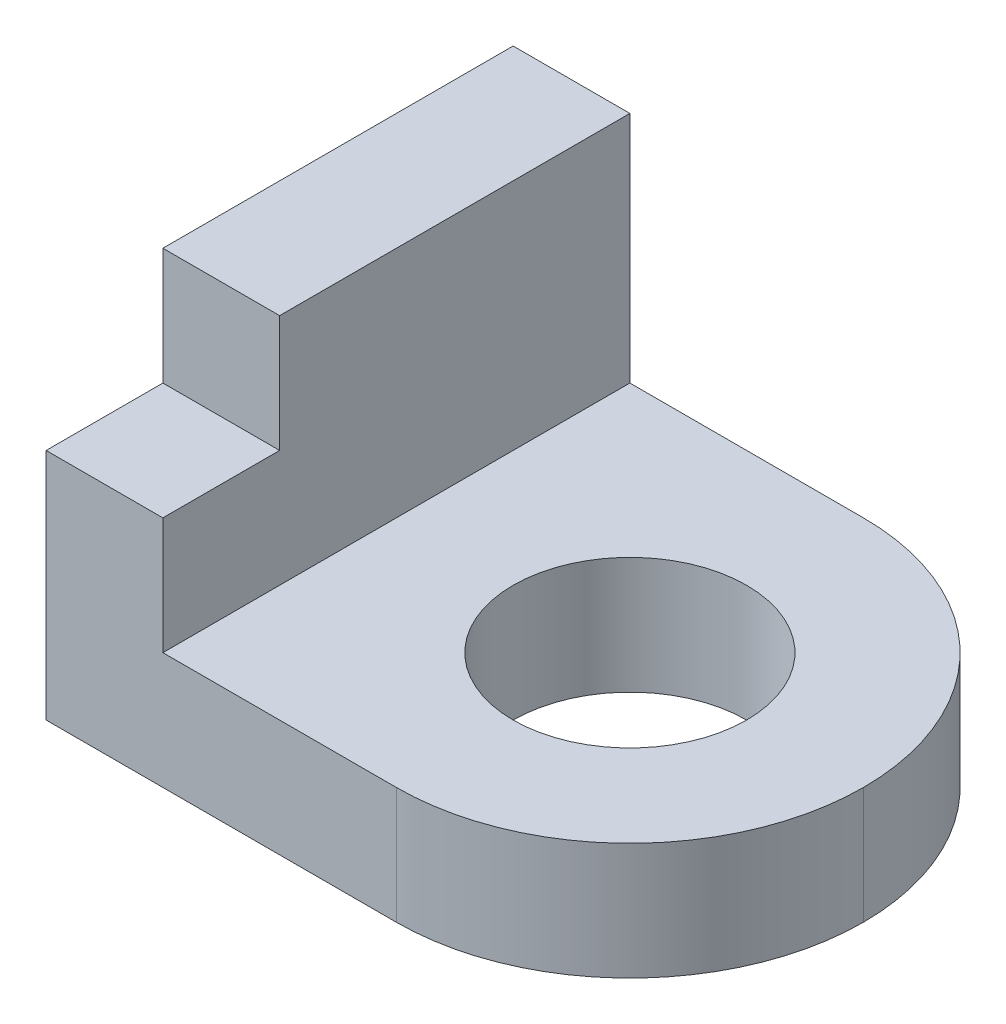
ISO-10303-21;
HEADER;
FILE_DESCRIPTION(('STEP AP214'),'2;1');
FILE_NAME('part.step','',(''),(''),'','','');
FILE_SCHEMA(('AUTOMOTIVE_DESIGN { 1 0 10303 214 1 1 1 1 }'));
ENDSEC;
DATA;
#1=APPLICATION_CONTEXT('core data for automotive mechanical design processes');
#2=APPLICATION_PROTOCOL_DEFINITION('international standard','automotive_design',2000,#1);
#3=PRODUCT_CONTEXT('',#1,'mechanical');
#4=PRODUCT('Part','Part','',(#3));
#5=PRODUCT_RELATED_PRODUCT_CATEGORY('part','',(#4));
#6=PRODUCT_DEFINITION_FORMATION('','',#4);
#7=PRODUCT_DEFINITION_CONTEXT('part definition',#1,'design');
#8=PRODUCT_DEFINITION('design','',#6,#7);
#9=PRODUCT_DEFINITION_SHAPE('','',#8);
#10=(LENGTH_UNIT() NAMED_UNIT(*) SI_UNIT(.MILLI.,.METRE.));
#11=(NAMED_UNIT(*) PLANE_ANGLE_UNIT() SI_UNIT($,.RADIAN.));
#12=(NAMED_UNIT(*) SI_UNIT($,.STERADIAN.) SOLID_ANGLE_UNIT());
#13=UNCERTAINTY_MEASURE_WITH_UNIT(LENGTH_MEASURE(1.E-05),#10,'distance_accuracy_value','');
#14=(GEOMETRIC_REPRESENTATION_CONTEXT(3) GLOBAL_UNCERTAINTY_ASSIGNED_CONTEXT((#13)) GLOBAL_UNIT_ASSIGNED_CONTEXT((#10,
#11,#12)) REPRESENTATION_CONTEXT('',''));
#15=CARTESIAN_POINT('',(0.,0.,0.));
#16=DIRECTION('',(0.,0.,1.));
#17=DIRECTION('',(1.,0.,0.));
#18=AXIS2_PLACEMENT_3D('',#15,#16,#17);
#19=CARTESIAN_POINT('',(-24.9460396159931,10.,-20.));
#20=DIRECTION('',(0.,0.,-1.));
#21=DIRECTION('',(-1.,0.,0.));
#22=AXIS2_PLACEMENT_3D('',#19,#20,#21);
#23=PLANE('',#22);
#24=DIRECTION('',(1.,0.,0.));
#25=VECTOR('',#24,1.);
#26=CARTESIAN_POINT('',(-24.9460396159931,10.,-20.));
#27=LINE('',#26,#25);
#28=CARTESIAN_POINT('',(10.,10.,-20.));
#29=VERTEX_POINT('',#28);
#30=CARTESIAN_POINT('',(30.,10.,-20.));
#31=VERTEX_POINT('',#30);
#32=EDGE_CURVE('E155',#29,#31,#27,.T.);
#33=ORIENTED_EDGE('',*,*,#32,.T.);
#34=DIRECTION('',(0.,-1.,0.));
#35=VECTOR('',#34,1.);
#36=CARTESIAN_POINT('',(30.,10.,-20.));
#37=LINE('',#36,#35);
#38=CARTESIAN_POINT('',(30.,0.,-20.));
#39=VERTEX_POINT('',#38);
#40=EDGE_CURVE('E158',#31,#39,#37,.T.);
#41=ORIENTED_EDGE('',*,*,#40,.T.);
#42=DIRECTION('',(1.,0.,0.));
#43=VECTOR('',#42,1.);
#44=CARTESIAN_POINT('',(-24.9460396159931,0.,-20.));
#45=LINE('',#44,#43);
#46=CARTESIAN_POINT('',(0.,0.,-20.));
#47=VERTEX_POINT('',#46);
#48=EDGE_CURVE('E148',#47,#39,#45,.T.);
#49=ORIENTED_EDGE('',*,*,#48,.F.);
#50=DIRECTION('',(0.,-1.,0.));
#51=VECTOR('',#50,1.);
#52=CARTESIAN_POINT('',(0.,30.,-20.));
#53=LINE('',#52,#51);
#54=CARTESIAN_POINT('',(0.,30.,-20.));
#55=VERTEX_POINT('',#54);
#56=EDGE_CURVE('E135',#55,#47,#53,.T.);
#57=ORIENTED_EDGE('',*,*,#56,.F.);
#58=DIRECTION('',(1.,0.,0.));
#59=VECTOR('',#58,1.);
#60=CARTESIAN_POINT('',(-24.9460396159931,30.,-20.));
#61=LINE('',#60,#59);
#62=CARTESIAN_POINT('',(10.,30.,-20.));
#63=VERTEX_POINT('',#62);
#64=EDGE_CURVE('E123',#55,#63,#61,.T.);
#65=ORIENTED_EDGE('',*,*,#64,.T.);
#66=DIRECTION('',(0.,-1.,0.));
#67=VECTOR('',#66,1.);
#68=CARTESIAN_POINT('',(10.,30.,-20.));
#69=LINE('',#68,#67);
#70=EDGE_CURVE('E138',#63,#29,#69,.T.);
#71=ORIENTED_EDGE('',*,*,#70,.T.);
#72=EDGE_LOOP('',(#33,#41,#49,#57,#65,#71));
#73=FACE_BOUND('',#72,.T.);
#74=ADVANCED_FACE('F32',(#73),#23,.T.);
#75=CARTESIAN_POINT('',(-24.9460396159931,10.,20.));
#76=DIRECTION('',(0.,0.,-1.));
#77=DIRECTION('',(-1.,0.,0.));
#78=AXIS2_PLACEMENT_3D('',#75,#76,#77);
#79=PLANE('',#78);
#80=DIRECTION('',(0.,-1.,0.));
#81=VECTOR('',#80,1.);
#82=CARTESIAN_POINT('',(10.,30.,20.));
#83=LINE('',#82,#81);
#84=CARTESIAN_POINT('',(10.,20.,20.));
#85=VERTEX_POINT('',#84);
#86=CARTESIAN_POINT('',(10.,10.,20.));
#87=VERTEX_POINT('',#86);
#88=EDGE_CURVE('E36',#85,#87,#83,.T.);
#89=ORIENTED_EDGE('',*,*,#88,.F.);
#90=DIRECTION('',(-1.,0.,0.));
#91=VECTOR('',#90,1.);
#92=CARTESIAN_POINT('',(50.,20.,20.));
#93=LINE('',#92,#91);
#94=CARTESIAN_POINT('',(0.,20.,20.));
#95=VERTEX_POINT('',#94);
#96=EDGE_CURVE('E191',#85,#95,#93,.T.);
#97=ORIENTED_EDGE('',*,*,#96,.T.);
#98=DIRECTION('',(0.,-1.,0.));
#99=VECTOR('',#98,1.);
#100=CARTESIAN_POINT('',(0.,30.,20.));
#101=LINE('',#100,#99);
#102=CARTESIAN_POINT('',(0.,0.,20.));
#103=VERTEX_POINT('',#102);
#104=EDGE_CURVE('E145',#95,#103,#101,.T.);
#105=ORIENTED_EDGE('',*,*,#104,.T.);
#106=DIRECTION('',(1.,0.,0.));
#107=VECTOR('',#106,1.);
#108=CARTESIAN_POINT('',(-24.9460396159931,0.,20.));
#109=LINE('',#108,#107);
#110=CARTESIAN_POINT('',(30.,0.,20.));
#111=VERTEX_POINT('',#110);
#112=EDGE_CURVE('E156',#103,#111,#109,.T.);
#113=ORIENTED_EDGE('',*,*,#112,.T.);
#114=DIRECTION('',(0.,-1.,0.));
#115=VECTOR('',#114,1.);
#116=CARTESIAN_POINT('',(30.,10.,20.));
#117=LINE('',#116,#115);
#118=CARTESIAN_POINT('',(30.,10.,20.));
#119=VERTEX_POINT('',#118);
#120=EDGE_CURVE('E42',#111,#119,#117,.F.);
#121=ORIENTED_EDGE('',*,*,#120,.T.);
#122=DIRECTION('',(1.,0.,0.));
#123=VECTOR('',#122,1.);
#124=CARTESIAN_POINT('',(-24.9460396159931,10.,20.));
#125=LINE('',#124,#123);
#126=EDGE_CURVE('E154',#87,#119,#125,.T.);
#127=ORIENTED_EDGE('',*,*,#126,.F.);
#128=EDGE_LOOP('',(#89,#97,#105,#113,#121,#127));
#129=FACE_BOUND('',#128,.T.);
#130=ADVANCED_FACE('F200',(#129),#79,.F.);
#131=CARTESIAN_POINT('',(-24.9460396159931,10.,0.));
#132=DIRECTION('',(0.,1.,0.));
#133=DIRECTION('',(0.,0.,1.));
#134=AXIS2_PLACEMENT_3D('',#131,#132,#133);
#135=PLANE('',#134);
#136=CARTESIAN_POINT('',(30.,10.,0.));
#137=DIRECTION('',(0.,1.,0.));
#138=DIRECTION('',(0.,0.,1.));
#139=AXIS2_PLACEMENT_3D('',#136,#137,#138);
#140=CIRCLE('',#139,10.);
#141=CARTESIAN_POINT('',(30.,10.,10.));
#142=VERTEX_POINT('',#141);
#143=EDGE_CURVE('E132',#142,#142,#140,.T.);
#144=ORIENTED_EDGE('',*,*,#143,.F.);
#145=EDGE_LOOP('',(#144));
#146=FACE_BOUND('',#145,.T.);
#147=CARTESIAN_POINT('',(30.,10.,0.));
#148=DIRECTION('',(0.,1.,0.));
#149=DIRECTION('',(0.,0.,1.));
#150=AXIS2_PLACEMENT_3D('',#147,#148,#149);
#151=CIRCLE('',#150,20.);
#152=CARTESIAN_POINT('',(50.,10.,0.));
#153=VERTEX_POINT('',#152);
#154=EDGE_CURVE('E171',#119,#153,#151,.T.);
#155=ORIENTED_EDGE('',*,*,#154,.T.);
#156=CARTESIAN_POINT('',(30.,10.,0.));
#157=DIRECTION('',(0.,1.,0.));
#158=DIRECTION('',(0.,0.,1.));
#159=AXIS2_PLACEMENT_3D('',#156,#157,#158);
#160=CIRCLE('',#159,20.);
#161=EDGE_CURVE('E173',#153,#31,#160,.T.);
#162=ORIENTED_EDGE('',*,*,#161,.T.);
#163=ORIENTED_EDGE('',*,*,#32,.F.);
#164=DIRECTION('',(0.,0.,1.));
#165=VECTOR('',#164,1.);
#166=CARTESIAN_POINT('',(10.,10.,0.));
#167=LINE('',#166,#165);
#168=EDGE_CURVE('E151',#29,#87,#167,.T.);
#169=ORIENTED_EDGE('',*,*,#168,.T.);
#170=ORIENTED_EDGE('',*,*,#126,.T.);
#171=EDGE_LOOP('',(#155,#162,#163,#169,#170));
#172=FACE_BOUND('',#171,.T.);
#173=ADVANCED_FACE('F208',(#146,#172),#135,.T.);
#174=CARTESIAN_POINT('',(-24.9460396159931,0.,0.));
#175=DIRECTION('',(0.,1.,0.));
#176=DIRECTION('',(0.,0.,1.));
#177=AXIS2_PLACEMENT_3D('',#174,#175,#176);
#178=PLANE('',#177);
#179=CARTESIAN_POINT('',(30.,0.,0.));
#180=DIRECTION('',(0.,-1.,0.));
#181=DIRECTION('',(0.,0.,-1.));
#182=AXIS2_PLACEMENT_3D('',#179,#180,#181);
#183=CIRCLE('',#182,10.);
#184=CARTESIAN_POINT('',(30.,0.,-10.));
#185=VERTEX_POINT('',#184);
#186=EDGE_CURVE('E181',#185,#185,#183,.T.);
#187=ORIENTED_EDGE('',*,*,#186,.F.);
#188=EDGE_LOOP('',(#187));
#189=FACE_BOUND('',#188,.T.);
#190=ORIENTED_EDGE('',*,*,#48,.T.);
#191=CARTESIAN_POINT('',(30.,0.,0.));
#192=DIRECTION('',(0.,1.,0.));
#193=DIRECTION('',(0.,0.,1.));
#194=AXIS2_PLACEMENT_3D('',#191,#192,#193);
#195=CIRCLE('',#194,20.);
#196=CARTESIAN_POINT('',(50.,0.,0.));
#197=VERTEX_POINT('',#196);
#198=EDGE_CURVE('E169',#39,#197,#195,.F.);
#199=ORIENTED_EDGE('',*,*,#198,.T.);
#200=CARTESIAN_POINT('',(30.,0.,0.));
#201=DIRECTION('',(0.,1.,0.));
#202=DIRECTION('',(0.,0.,1.));
#203=AXIS2_PLACEMENT_3D('',#200,#201,#202);
#204=CIRCLE('',#203,20.);
#205=EDGE_CURVE('E167',#197,#111,#204,.F.);
#206=ORIENTED_EDGE('',*,*,#205,.T.);
#207=ORIENTED_EDGE('',*,*,#112,.F.);
#208=DIRECTION('',(0.,0.,1.));
#209=VECTOR('',#208,1.);
#210=CARTESIAN_POINT('',(0.,0.,0.));
#211=LINE('',#210,#209);
#212=EDGE_CURVE('E125',#47,#103,#211,.T.);
#213=ORIENTED_EDGE('',*,*,#212,.F.);
#214=EDGE_LOOP('',(#190,#199,#206,#207,#213));
#215=FACE_BOUND('',#214,.T.);
#216=ADVANCED_FACE('F215',(#189,#215),#178,.F.);
#217=CARTESIAN_POINT('',(10.,30.,0.));
#218=DIRECTION('',(1.,0.,0.));
#219=DIRECTION('',(0.,0.,-1.));
#220=AXIS2_PLACEMENT_3D('',#217,#218,#219);
#221=PLANE('',#220);
#222=DIRECTION('',(0.,0.,-1.));
#223=VECTOR('',#222,1.);
#224=CARTESIAN_POINT('',(10.,20.,0.));
#225=LINE('',#224,#223);
#226=CARTESIAN_POINT('',(10.,20.,10.));
#227=VERTEX_POINT('',#226);
#228=EDGE_CURVE('E185',#85,#227,#225,.T.);
#229=ORIENTED_EDGE('',*,*,#228,.F.);
#230=ORIENTED_EDGE('',*,*,#88,.T.);
#231=ORIENTED_EDGE('',*,*,#168,.F.);
#232=ORIENTED_EDGE('',*,*,#70,.F.);
#233=DIRECTION('',(0.,0.,1.));
#234=VECTOR('',#233,1.);
#235=CARTESIAN_POINT('',(10.,30.,0.));
#236=LINE('',#235,#234);
#237=CARTESIAN_POINT('',(10.,30.,10.));
#238=VERTEX_POINT('',#237);
#239=EDGE_CURVE('E124',#63,#238,#236,.T.);
#240=ORIENTED_EDGE('',*,*,#239,.T.);
#241=DIRECTION('',(0.,1.,0.));
#242=VECTOR('',#241,1.);
#243=CARTESIAN_POINT('',(10.,30.,10.));
#244=LINE('',#243,#242);
#245=EDGE_CURVE('E48',#227,#238,#244,.T.);
#246=ORIENTED_EDGE('',*,*,#245,.F.);
#247=EDGE_LOOP('',(#229,#230,#231,#232,#240,#246));
#248=FACE_BOUND('',#247,.T.);
#249=ADVANCED_FACE('F205',(#248),#221,.T.);
#250=CARTESIAN_POINT('',(0.,30.,0.));
#251=DIRECTION('',(1.,0.,0.));
#252=DIRECTION('',(0.,0.,-1.));
#253=AXIS2_PLACEMENT_3D('',#250,#251,#252);
#254=PLANE('',#253);
#255=ORIENTED_EDGE('',*,*,#104,.F.);
#256=DIRECTION('',(0.,0.,1.));
#257=VECTOR('',#256,1.);
#258=CARTESIAN_POINT('',(0.,20.,20.));
#259=LINE('',#258,#257);
#260=CARTESIAN_POINT('',(0.,20.,10.));
#261=VERTEX_POINT('',#260);
#262=EDGE_CURVE('E119',#261,#95,#259,.T.);
#263=ORIENTED_EDGE('',*,*,#262,.F.);
#264=DIRECTION('',(0.,-1.,0.));
#265=VECTOR('',#264,1.);
#266=CARTESIAN_POINT('',(0.,30.,10.));
#267=LINE('',#266,#265);
#268=CARTESIAN_POINT('',(0.,30.,10.));
#269=VERTEX_POINT('',#268);
#270=EDGE_CURVE('E106',#269,#261,#267,.T.);
#271=ORIENTED_EDGE('',*,*,#270,.F.);
#272=DIRECTION('',(0.,0.,1.));
#273=VECTOR('',#272,1.);
#274=CARTESIAN_POINT('',(0.,30.,0.));
#275=LINE('',#274,#273);
#276=EDGE_CURVE('E117',#55,#269,#275,.T.);
#277=ORIENTED_EDGE('',*,*,#276,.F.);
#278=ORIENTED_EDGE('',*,*,#56,.T.);
#279=ORIENTED_EDGE('',*,*,#212,.T.);
#280=EDGE_LOOP('',(#255,#263,#271,#277,#278,#279));
#281=FACE_BOUND('',#280,.T.);
#282=ADVANCED_FACE('F115',(#281),#254,.F.);
#283=CARTESIAN_POINT('',(-24.9460396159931,30.,0.));
#284=DIRECTION('',(0.,1.,0.));
#285=DIRECTION('',(0.,0.,1.));
#286=AXIS2_PLACEMENT_3D('',#283,#284,#285);
#287=PLANE('',#286);
#288=DIRECTION('',(-1.,0.,0.));
#289=VECTOR('',#288,1.);
#290=CARTESIAN_POINT('',(-24.9460396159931,30.,10.));
#291=LINE('',#290,#289);
#292=EDGE_CURVE('E11',#238,#269,#291,.T.);
#293=ORIENTED_EDGE('',*,*,#292,.F.);
#294=ORIENTED_EDGE('',*,*,#239,.F.);
#295=ORIENTED_EDGE('',*,*,#64,.F.);
#296=ORIENTED_EDGE('',*,*,#276,.T.);
#297=EDGE_LOOP('',(#293,#294,#295,#296));
#298=FACE_BOUND('',#297,.T.);
#299=ADVANCED_FACE('F121',(#298),#287,.T.);
#300=CARTESIAN_POINT('',(30.,10.,0.));
#301=DIRECTION('',(0.,1.,0.));
#302=DIRECTION('',(0.,0.,1.));
#303=AXIS2_PLACEMENT_3D('',#300,#301,#302);
#304=CYLINDRICAL_SURFACE('',#303,20.);
#305=DIRECTION('',(0.,-1.,0.));
#306=VECTOR('',#305,1.);
#307=CARTESIAN_POINT('',(50.,0.,0.));
#308=LINE('',#307,#306);
#309=EDGE_CURVE('E129',#153,#197,#308,.T.);
#310=ORIENTED_EDGE('',*,*,#309,.F.);
#311=ORIENTED_EDGE('',*,*,#154,.F.);
#312=ORIENTED_EDGE('',*,*,#120,.F.);
#313=ORIENTED_EDGE('',*,*,#205,.F.);
#314=EDGE_LOOP('',(#310,#311,#312,#313));
#315=FACE_BOUND('',#314,.T.);
#316=ADVANCED_FACE('F34',(#315),#304,.T.);
#317=CARTESIAN_POINT('',(30.,10.,0.));
#318=DIRECTION('',(0.,-1.,0.));
#319=DIRECTION('',(0.,0.,-1.));
#320=AXIS2_PLACEMENT_3D('',#317,#318,#319);
#321=CYLINDRICAL_SURFACE('',#320,20.);
#322=ORIENTED_EDGE('',*,*,#161,.F.);
#323=ORIENTED_EDGE('',*,*,#309,.T.);
#324=ORIENTED_EDGE('',*,*,#198,.F.);
#325=ORIENTED_EDGE('',*,*,#40,.F.);
#326=EDGE_LOOP('',(#322,#323,#324,#325));
#327=FACE_BOUND('',#326,.T.);
#328=ADVANCED_FACE('F212',(#327),#321,.T.);
#329=CARTESIAN_POINT('',(30.,30.000025,0.));
#330=DIRECTION('',(0.,-1.,0.));
#331=DIRECTION('',(0.,0.,-1.));
#332=AXIS2_PLACEMENT_3D('',#329,#330,#331);
#333=CYLINDRICAL_SURFACE('',#332,10.);
#334=ORIENTED_EDGE('',*,*,#143,.T.);
#335=EDGE_LOOP('',(#334));
#336=FACE_BOUND('',#335,.T.);
#337=ORIENTED_EDGE('',*,*,#186,.T.);
#338=EDGE_LOOP('',(#337));
#339=FACE_BOUND('',#338,.T.);
#340=ADVANCED_FACE('F222',(#336,#339),#333,.F.);
#341=CARTESIAN_POINT('',(50.,20.,20.));
#342=DIRECTION('',(0.,-1.,0.));
#343=DIRECTION('',(0.,0.,-1.));
#344=AXIS2_PLACEMENT_3D('',#341,#342,#343);
#345=PLANE('',#344);
#346=ORIENTED_EDGE('',*,*,#228,.T.);
#347=DIRECTION('',(-1.,0.,0.));
#348=VECTOR('',#347,1.);
#349=CARTESIAN_POINT('',(50.,20.,10.));
#350=LINE('',#349,#348);
#351=EDGE_CURVE('E192',#227,#261,#350,.T.);
#352=ORIENTED_EDGE('',*,*,#351,.T.);
#353=ORIENTED_EDGE('',*,*,#262,.T.);
#354=ORIENTED_EDGE('',*,*,#96,.F.);
#355=EDGE_LOOP('',(#346,#352,#353,#354));
#356=FACE_BOUND('',#355,.T.);
#357=ADVANCED_FACE('F197',(#356),#345,.F.);
#358=CARTESIAN_POINT('',(50.,30.,10.));
#359=DIRECTION('',(0.,0.,-1.));
#360=DIRECTION('',(0.,1.,0.));
#361=AXIS2_PLACEMENT_3D('',#358,#359,#360);
#362=PLANE('',#361);
#363=ORIENTED_EDGE('',*,*,#245,.T.);
#364=ORIENTED_EDGE('',*,*,#292,.T.);
#365=ORIENTED_EDGE('',*,*,#270,.T.);
#366=ORIENTED_EDGE('',*,*,#351,.F.);
#367=EDGE_LOOP('',(#363,#364,#365,#366));
#368=FACE_BOUND('',#367,.T.);
#369=ADVANCED_FACE('F105',(#368),#362,.F.);
#370=CLOSED_SHELL('',(#74,#130,#173,#216,#249,#282,#299,#316,#328,#340,#357,#369));
#371=MANIFOLD_SOLID_BREP('B2',#370);
#372=ADVANCED_BREP_SHAPE_REPRESENTATION('',(#18,#371),#14);
#373=SHAPE_DEFINITION_REPRESENTATION(#9,#372);
ENDSEC;
END-ISO-10303-21;
